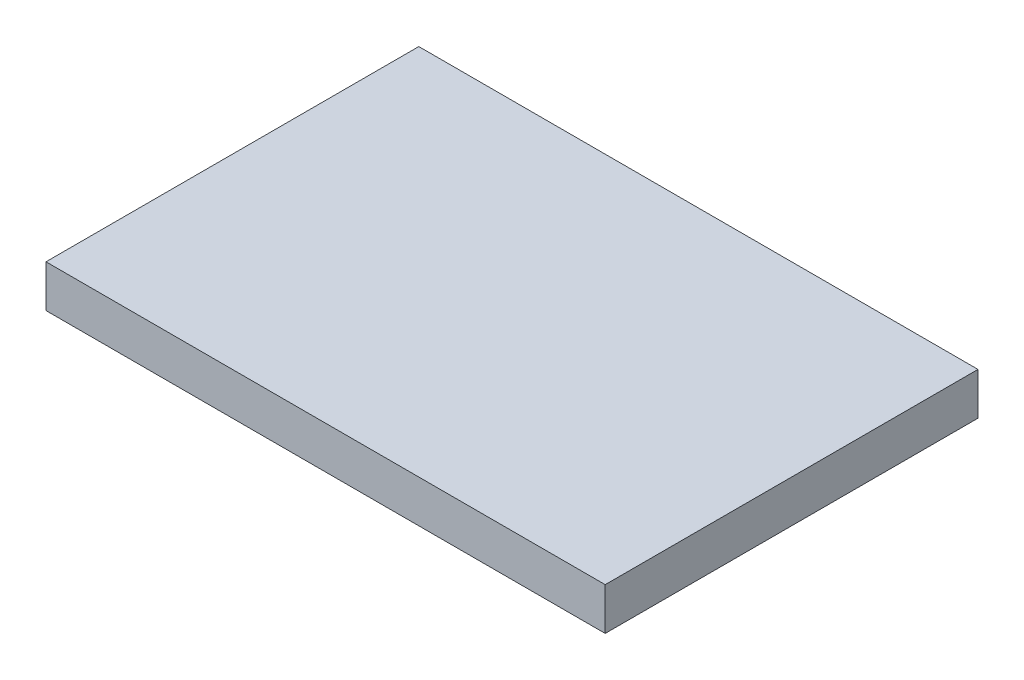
from build123d import *

# Parameters (mm, degrees)
SKETCH1_W           = 84
SKETCH1_H           = 56
BOSS_EXTRUDE1_DEPTH = 6.35


with BuildPart() as part:
    # Sketch1 → Boss-Extrude1 (new body)
    with BuildSketch(Plane(origin=(0, 0, 0), x_dir=(1, 0, 0), z_dir=(0, 1, 0))):
        with Locations((42, 28)):
            Rectangle(SKETCH1_W, SKETCH1_H)
    extrude(amount=BOSS_EXTRUDE1_DEPTH)


solid = part.part
